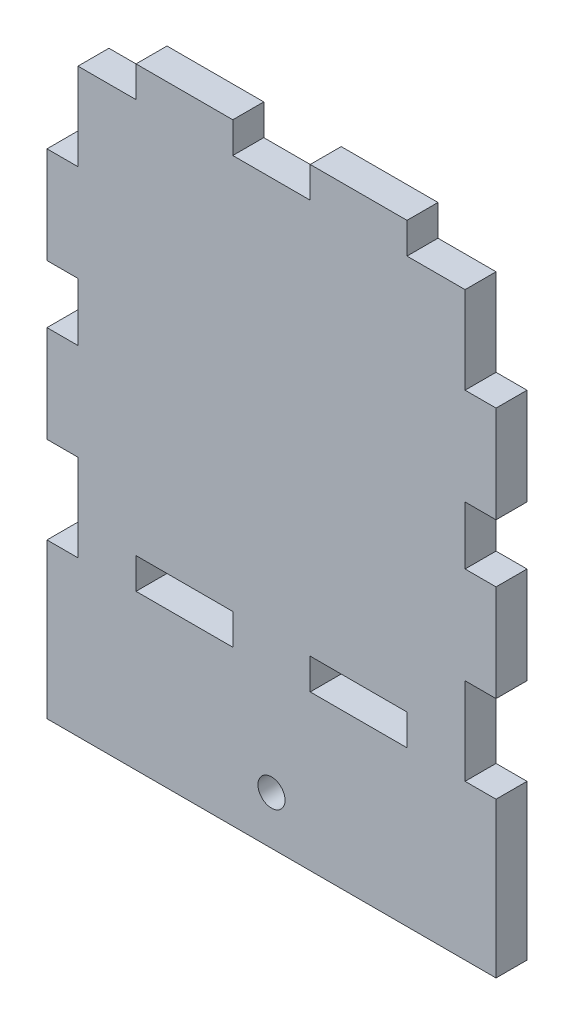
from build123d import *

# Parameters (mm, degrees)
SKETCH1_R           = 7
SKETCH1_W           = 50
SKETCH1_H           = 16
BOSS_EXTRUDE1_DEPTH = 16


with BuildPart() as part:
    # Sketch1 → Boss-Extrude1 (new body)
    with BuildSketch(Plane.XY):
        Polygon((0, 80), (-16, 80), (-16, 0), (216, 0), (216, 80), (200, 80), (200, 125), (216, 125), (216, 175), (200, 175), (200, 205), (216, 205), (216, 255), (200, 255), (200, 300), (170, 300), (170, 316), (120, 316), (120, 300), (80, 300), (80, 316), (30, 316), (30, 300), (0, 300), (0, 255), (-16, 255), (-16, 205), (0, 205), (0, 175), (-16, 175), (-16, 125), (0, 125), align=None)
        with Locations((100, 25)):
            Circle(SKETCH1_R, mode=Mode.SUBTRACT)
        with Locations((55, 88)):
            Rectangle(SKETCH1_W, SKETCH1_H, mode=Mode.SUBTRACT)
        with Locations((145, 88)):
            Rectangle(SKETCH1_W, SKETCH1_H, mode=Mode.SUBTRACT)
    extrude(amount=-BOSS_EXTRUDE1_DEPTH)


solid = part.part
